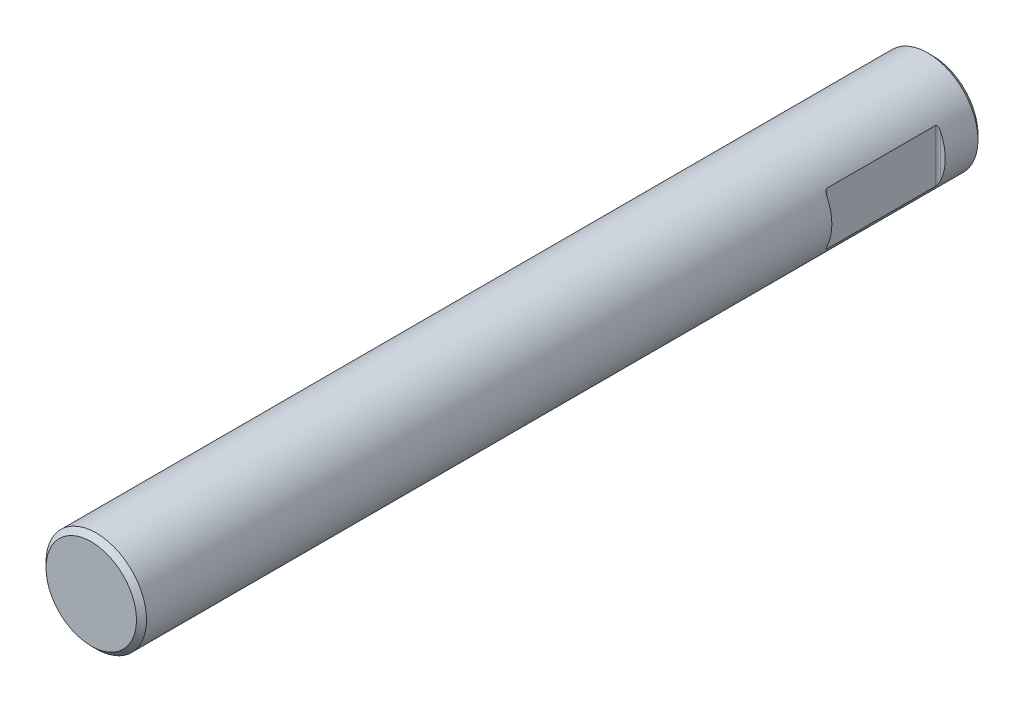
from build123d import *

# Parameters (mm, degrees)
SKIZZE1_W                            = 33.4
SKIZZE1_H                            = 1.995
FASE1_SIZE                           = 0.2
SCHNITT_LINEAR_AUSTRAGEN1_DEPTH      = 34.51895061
SCHNITT_LINEAR_AUSTRAGEN1_DEPTH_BACK = 34.51895061


with BuildPart() as part:
    # Skizze1 → Rotation1 (revolve)
    with BuildSketch(Plane(origin=(0, 0, 0), x_dir=(0, 0, -1), z_dir=(1, 0, 0)), mode=Mode.PRIVATE) as rotation1_sk:
        with Locations((16.7, 0.9975)):
            Rectangle(SKIZZE1_W, SKIZZE1_H)
    revolve(rotation1_sk.sketch.rotate(Axis((0, 0, 50.516901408), (0, 0, -1)), 90), axis=Axis((0, 0, 50.516901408), (0, 0, -1)))

    # Fase1
    fase1_edges = [part.edges().sort_by_distance(p)[0] for p in [
        (-1.995, 0, -33.4),
        (-1.995, 0, 0),
    ]]
    chamfer(fase1_edges, length=FASE1_SIZE)

    # Skizze2 → Schnitt-Linear austragen1 (cut, two sides: drawn at the far end of the back side and taken through both)
    with BuildSketch(Plane(origin=(0, 0, 0), x_dir=(1, 0, 0), z_dir=(0, 1, 0)).offset(-SCHNITT_LINEAR_AUSTRAGEN1_DEPTH_BACK)):
        with BuildLine():
            Line((-6.2, 27.4), (-1.8, 27.4))
            ThreePointArc((-1.8, 27.4), (-1.729289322, 27.429289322), (-1.7, 27.5))
            Line((-1.7, 27.5), (-1.7, 31.8))
            ThreePointArc((-1.7, 31.8), (-1.729289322, 31.870710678), (-1.8, 31.9))
            Line((-1.8, 31.9), (-6.2, 31.9))
            Line((-6.2, 31.9), (-6.2, 27.4))
        make_face()
        with BuildLine():
            Line((1.7, 27.5), (1.7, 31.8))
            ThreePointArc((1.7, 31.8), (1.729289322, 31.870710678), (1.8, 31.9))
            Line((1.8, 31.9), (6.2, 31.9))
            Line((6.2, 31.9), (6.2, 27.4))
            Line((6.2, 27.4), (1.8, 27.4))
            ThreePointArc((1.8, 27.4), (1.729289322, 27.429289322), (1.7, 27.5))
        make_face()
    extrude(amount=SCHNITT_LINEAR_AUSTRAGEN1_DEPTH + SCHNITT_LINEAR_AUSTRAGEN1_DEPTH_BACK, mode=Mode.SUBTRACT)


solid = part.part
